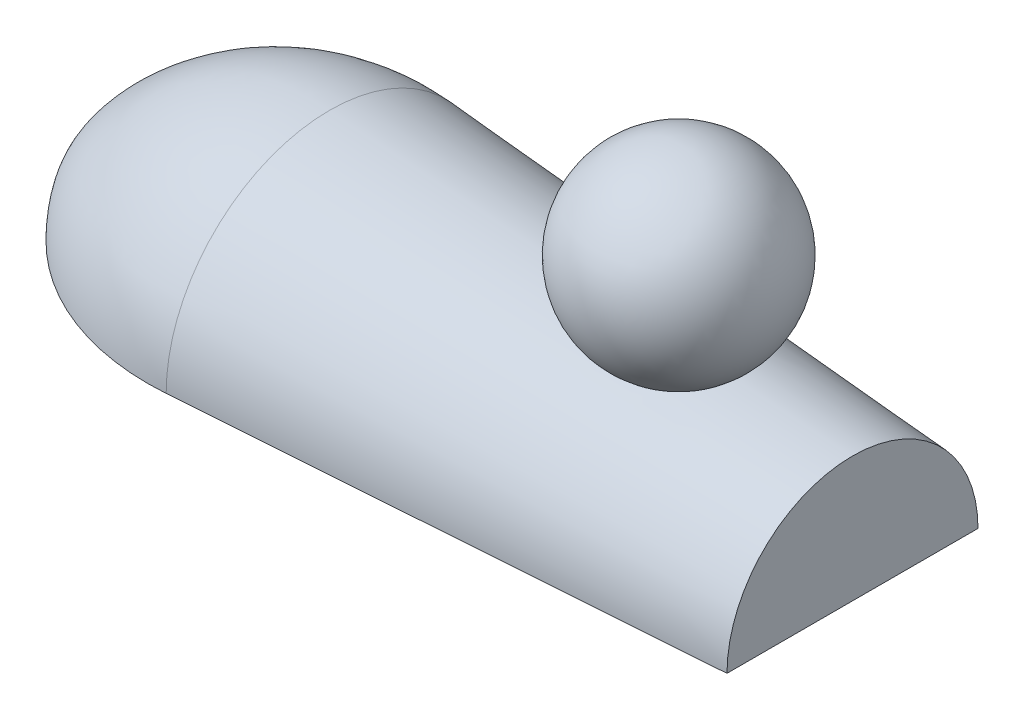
from build123d import *

# Parameters (mm, degrees)
OTO_IT_KOLEM_OSY2_ANGLE = 180


with BuildPart() as part:
    # Skica1 → Oto_it kolem osy1 (revolve)
    with BuildSketch(Plane.XY):
        with BuildLine():
            Line((0, 28.75), (0, -28.75))
            ThreePointArc((0, -28.75), (28.75, 0), (0, 28.75))
        make_face()
    revolve(axis=Axis((0, 28.75, 0), (0, -1, 0)))

    # Skica2 → Oto_it kolem osy2 (revolve)
    with BuildSketch(Plane(origin=(0, -63.25, 0), x_dir=(-1, 0, 0), z_dir=(0, 1, 0))):
        with BuildLine():
            Line((-51.75, 0), (178.25, 0))
            ThreePointArc((178.25, 0), (149.337262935, 36.911399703), (103.951908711, 48.682865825))
            Line((103.951908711, 48.682865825), (-51.75, 37.375))
            Line((-51.75, 37.375), (-51.75, 0))
        make_face()
    revolve(axis=Axis((51.75, -63.25, 0), (-1, 0, 0)), revolution_arc=OTO_IT_KOLEM_OSY2_ANGLE)


solid = part.part
